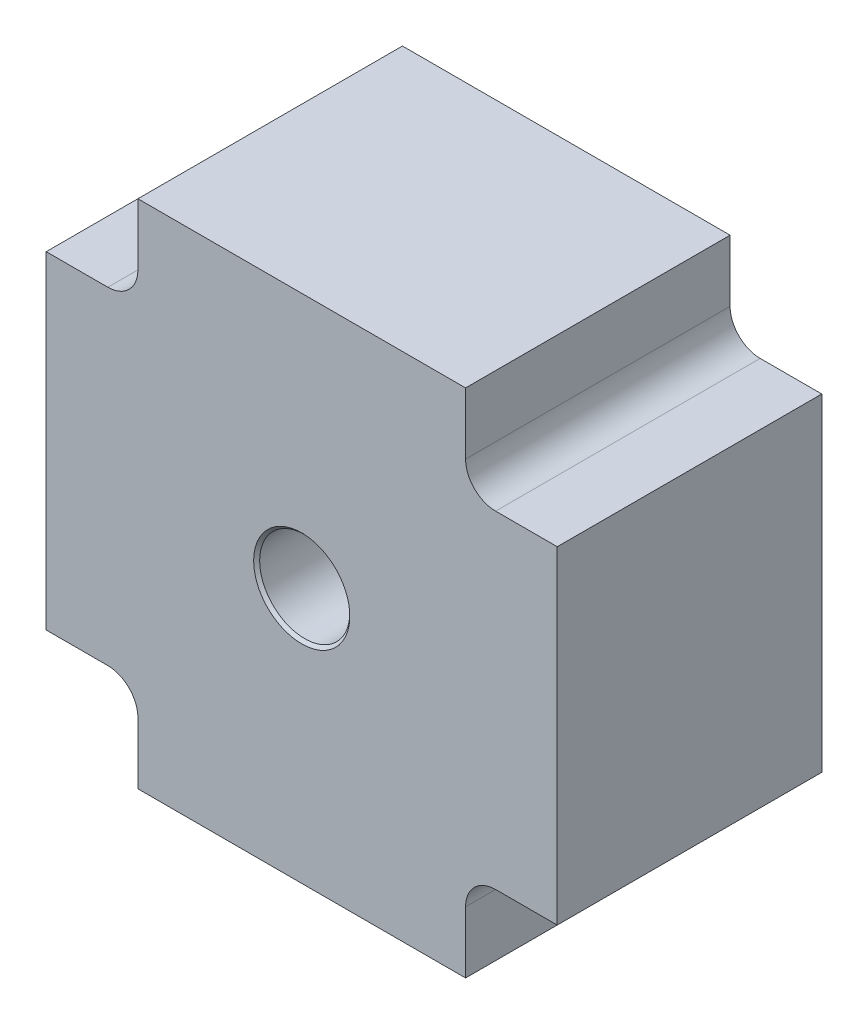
ISO-10303-21;
HEADER;
FILE_DESCRIPTION(('STEP AP214'),'2;1');
FILE_NAME('part.step','',(''),(''),'','','');
FILE_SCHEMA(('AUTOMOTIVE_DESIGN { 1 0 10303 214 1 1 1 1 }'));
ENDSEC;
DATA;
#1=APPLICATION_CONTEXT('core data for automotive mechanical design processes');
#2=APPLICATION_PROTOCOL_DEFINITION('international standard','automotive_design',2000,#1);
#3=PRODUCT_CONTEXT('',#1,'mechanical');
#4=PRODUCT('Part','Part','',(#3));
#5=PRODUCT_RELATED_PRODUCT_CATEGORY('part','',(#4));
#6=PRODUCT_DEFINITION_FORMATION('','',#4);
#7=PRODUCT_DEFINITION_CONTEXT('part definition',#1,'design');
#8=PRODUCT_DEFINITION('design','',#6,#7);
#9=PRODUCT_DEFINITION_SHAPE('','',#8);
#10=(LENGTH_UNIT() NAMED_UNIT(*) SI_UNIT(.MILLI.,.METRE.));
#11=(NAMED_UNIT(*) PLANE_ANGLE_UNIT() SI_UNIT($,.RADIAN.));
#12=(NAMED_UNIT(*) SI_UNIT($,.STERADIAN.) SOLID_ANGLE_UNIT());
#13=UNCERTAINTY_MEASURE_WITH_UNIT(LENGTH_MEASURE(1.E-05),#10,'distance_accuracy_value','');
#14=(GEOMETRIC_REPRESENTATION_CONTEXT(3) GLOBAL_UNCERTAINTY_ASSIGNED_CONTEXT((#13)) GLOBAL_UNIT_ASSIGNED_CONTEXT((#10,
#11,#12)) REPRESENTATION_CONTEXT('',''));
#15=CARTESIAN_POINT('',(0.,0.,0.));
#16=DIRECTION('',(0.,0.,1.));
#17=DIRECTION('',(1.,0.,0.));
#18=AXIS2_PLACEMENT_3D('',#15,#16,#17);
#19=CARTESIAN_POINT('',(-27.25,-27.25,44.));
#20=DIRECTION('',(1.,0.,0.));
#21=DIRECTION('',(0.,1.,0.));
#22=AXIS2_PLACEMENT_3D('',#19,#20,#21);
#23=PLANE('',#22);
#24=DIRECTION('',(0.,-1.,0.));
#25=VECTOR('',#24,1.);
#26=CARTESIAN_POINT('',(-27.25,-27.25,44.));
#27=LINE('',#26,#25);
#28=CARTESIAN_POINT('',(-27.25,-32.25,44.));
#29=VERTEX_POINT('',#28);
#30=CARTESIAN_POINT('',(-27.25,-42.5,44.));
#31=VERTEX_POINT('',#30);
#32=EDGE_CURVE('E149',#29,#31,#27,.T.);
#33=ORIENTED_EDGE('',*,*,#32,.F.);
#34=DIRECTION('',(0.,0.,-1.));
#35=VECTOR('',#34,1.);
#36=CARTESIAN_POINT('',(-27.25,-32.25,0.));
#37=LINE('',#36,#35);
#38=CARTESIAN_POINT('',(-27.25,-32.25,0.));
#39=VERTEX_POINT('',#38);
#40=EDGE_CURVE('E193',#29,#39,#37,.T.);
#41=ORIENTED_EDGE('',*,*,#40,.T.);
#42=DIRECTION('',(0.,-1.,0.));
#43=VECTOR('',#42,1.);
#44=CARTESIAN_POINT('',(-27.25,-27.25,0.));
#45=LINE('',#44,#43);
#46=CARTESIAN_POINT('',(-27.25,-42.5,0.));
#47=VERTEX_POINT('',#46);
#48=EDGE_CURVE('E174',#39,#47,#45,.T.);
#49=ORIENTED_EDGE('',*,*,#48,.T.);
#50=DIRECTION('',(0.,0.,-1.));
#51=VECTOR('',#50,1.);
#52=CARTESIAN_POINT('',(-27.25,-42.5,44.));
#53=LINE('',#52,#51);
#54=EDGE_CURVE('E167',#31,#47,#53,.T.);
#55=ORIENTED_EDGE('',*,*,#54,.F.);
#56=EDGE_LOOP('',(#33,#41,#49,#55));
#57=FACE_BOUND('',#56,.T.);
#58=ADVANCED_FACE('F37',(#57),#23,.F.);
#59=CARTESIAN_POINT('',(27.25,-42.5,44.));
#60=DIRECTION('',(0.,1.,0.));
#61=DIRECTION('',(-1.,0.,0.));
#62=AXIS2_PLACEMENT_3D('',#59,#60,#61);
#63=PLANE('',#62);
#64=DIRECTION('',(1.,0.,0.));
#65=VECTOR('',#64,1.);
#66=CARTESIAN_POINT('',(27.25,-42.5,0.));
#67=LINE('',#66,#65);
#68=CARTESIAN_POINT('',(27.25,-42.5,0.));
#69=VERTEX_POINT('',#68);
#70=EDGE_CURVE('E292',#47,#69,#67,.T.);
#71=ORIENTED_EDGE('',*,*,#70,.T.);
#72=DIRECTION('',(0.,0.,-1.));
#73=VECTOR('',#72,1.);
#74=CARTESIAN_POINT('',(27.25,-42.5,44.));
#75=LINE('',#74,#73);
#76=CARTESIAN_POINT('',(27.25,-42.5,44.));
#77=VERTEX_POINT('',#76);
#78=EDGE_CURVE('E169',#77,#69,#75,.T.);
#79=ORIENTED_EDGE('',*,*,#78,.F.);
#80=DIRECTION('',(1.,0.,0.));
#81=VECTOR('',#80,1.);
#82=CARTESIAN_POINT('',(27.25,-42.5,44.));
#83=LINE('',#82,#81);
#84=EDGE_CURVE('E154',#31,#77,#83,.T.);
#85=ORIENTED_EDGE('',*,*,#84,.F.);
#86=ORIENTED_EDGE('',*,*,#54,.T.);
#87=EDGE_LOOP('',(#71,#79,#85,#86));
#88=FACE_BOUND('',#87,.T.);
#89=ADVANCED_FACE('F166',(#88),#63,.F.);
#90=CARTESIAN_POINT('',(27.25,-27.25,44.));
#91=DIRECTION('',(-1.,0.,0.));
#92=DIRECTION('',(0.,0.,1.));
#93=AXIS2_PLACEMENT_3D('',#90,#91,#92);
#94=PLANE('',#93);
#95=DIRECTION('',(0.,1.,0.));
#96=VECTOR('',#95,1.);
#97=CARTESIAN_POINT('',(27.25,-27.25,0.));
#98=LINE('',#97,#96);
#99=CARTESIAN_POINT('',(27.25,-32.25,0.));
#100=VERTEX_POINT('',#99);
#101=EDGE_CURVE('E291',#69,#100,#98,.T.);
#102=ORIENTED_EDGE('',*,*,#101,.T.);
#103=DIRECTION('',(0.,0.,-1.));
#104=VECTOR('',#103,1.);
#105=CARTESIAN_POINT('',(27.25,-32.25,44.));
#106=LINE('',#105,#104);
#107=CARTESIAN_POINT('',(27.25,-32.25,44.));
#108=VERTEX_POINT('',#107);
#109=EDGE_CURVE('E200',#100,#108,#106,.F.);
#110=ORIENTED_EDGE('',*,*,#109,.T.);
#111=DIRECTION('',(0.,1.,0.));
#112=VECTOR('',#111,1.);
#113=CARTESIAN_POINT('',(27.25,-27.25,44.));
#114=LINE('',#113,#112);
#115=EDGE_CURVE('E171',#77,#108,#114,.T.);
#116=ORIENTED_EDGE('',*,*,#115,.F.);
#117=ORIENTED_EDGE('',*,*,#78,.T.);
#118=EDGE_LOOP('',(#102,#110,#116,#117));
#119=FACE_BOUND('',#118,.T.);
#120=ADVANCED_FACE('F317',(#119),#94,.F.);
#121=CARTESIAN_POINT('',(42.5,-27.25,44.));
#122=DIRECTION('',(0.,1.,0.));
#123=DIRECTION('',(0.,0.,1.));
#124=AXIS2_PLACEMENT_3D('',#121,#122,#123);
#125=PLANE('',#124);
#126=DIRECTION('',(1.,0.,0.));
#127=VECTOR('',#126,1.);
#128=CARTESIAN_POINT('',(42.5,-27.25,44.));
#129=LINE('',#128,#127);
#130=CARTESIAN_POINT('',(32.25,-27.25,44.));
#131=VERTEX_POINT('',#130);
#132=CARTESIAN_POINT('',(42.5,-27.25,44.));
#133=VERTEX_POINT('',#132);
#134=EDGE_CURVE('E307',#131,#133,#129,.T.);
#135=ORIENTED_EDGE('',*,*,#134,.F.);
#136=DIRECTION('',(0.,0.,-1.));
#137=VECTOR('',#136,1.);
#138=CARTESIAN_POINT('',(32.25,-27.25,0.));
#139=LINE('',#138,#137);
#140=CARTESIAN_POINT('',(32.25,-27.25,0.));
#141=VERTEX_POINT('',#140);
#142=EDGE_CURVE('E197',#131,#141,#139,.T.);
#143=ORIENTED_EDGE('',*,*,#142,.T.);
#144=DIRECTION('',(1.,0.,0.));
#145=VECTOR('',#144,1.);
#146=CARTESIAN_POINT('',(42.5,-27.25,0.));
#147=LINE('',#146,#145);
#148=CARTESIAN_POINT('',(42.5,-27.25,0.));
#149=VERTEX_POINT('',#148);
#150=EDGE_CURVE('E256',#141,#149,#147,.T.);
#151=ORIENTED_EDGE('',*,*,#150,.T.);
#152=DIRECTION('',(0.,0.,-1.));
#153=VECTOR('',#152,1.);
#154=CARTESIAN_POINT('',(42.5,-27.25,44.));
#155=LINE('',#154,#153);
#156=EDGE_CURVE('E181',#133,#149,#155,.T.);
#157=ORIENTED_EDGE('',*,*,#156,.F.);
#158=EDGE_LOOP('',(#135,#143,#151,#157));
#159=FACE_BOUND('',#158,.T.);
#160=ADVANCED_FACE('F315',(#159),#125,.F.);
#161=CARTESIAN_POINT('',(42.5,-27.25,44.));
#162=DIRECTION('',(-1.,0.,0.));
#163=DIRECTION('',(0.,0.,1.));
#164=AXIS2_PLACEMENT_3D('',#161,#162,#163);
#165=PLANE('',#164);
#166=DIRECTION('',(0.,1.,0.));
#167=VECTOR('',#166,1.);
#168=CARTESIAN_POINT('',(42.5,-27.25,0.));
#169=LINE('',#168,#167);
#170=CARTESIAN_POINT('',(42.5,27.25,0.));
#171=VERTEX_POINT('',#170);
#172=EDGE_CURVE('E252',#149,#171,#169,.T.);
#173=ORIENTED_EDGE('',*,*,#172,.T.);
#174=DIRECTION('',(0.,0.,-1.));
#175=VECTOR('',#174,1.);
#176=CARTESIAN_POINT('',(42.5,27.25,44.));
#177=LINE('',#176,#175);
#178=CARTESIAN_POINT('',(42.5,27.25,44.));
#179=VERTEX_POINT('',#178);
#180=EDGE_CURVE('E251',#179,#171,#177,.T.);
#181=ORIENTED_EDGE('',*,*,#180,.F.);
#182=DIRECTION('',(0.,1.,0.));
#183=VECTOR('',#182,1.);
#184=CARTESIAN_POINT('',(42.5,-27.25,44.));
#185=LINE('',#184,#183);
#186=EDGE_CURVE('E285',#133,#179,#185,.T.);
#187=ORIENTED_EDGE('',*,*,#186,.F.);
#188=ORIENTED_EDGE('',*,*,#156,.T.);
#189=EDGE_LOOP('',(#173,#181,#187,#188));
#190=FACE_BOUND('',#189,.T.);
#191=ADVANCED_FACE('F284',(#190),#165,.F.);
#192=CARTESIAN_POINT('',(42.5,27.25,44.));
#193=DIRECTION('',(0.,-1.,0.));
#194=DIRECTION('',(1.,0.,0.));
#195=AXIS2_PLACEMENT_3D('',#192,#193,#194);
#196=PLANE('',#195);
#197=DIRECTION('',(-1.,0.,0.));
#198=VECTOR('',#197,1.);
#199=CARTESIAN_POINT('',(42.5,27.25,0.));
#200=LINE('',#199,#198);
#201=CARTESIAN_POINT('',(32.25,27.25,0.));
#202=VERTEX_POINT('',#201);
#203=EDGE_CURVE('E244',#171,#202,#200,.T.);
#204=ORIENTED_EDGE('',*,*,#203,.T.);
#205=DIRECTION('',(0.,0.,-1.));
#206=VECTOR('',#205,1.);
#207=CARTESIAN_POINT('',(32.25,27.25,44.));
#208=LINE('',#207,#206);
#209=CARTESIAN_POINT('',(32.25,27.25,44.));
#210=VERTEX_POINT('',#209);
#211=EDGE_CURVE('E205',#202,#210,#208,.F.);
#212=ORIENTED_EDGE('',*,*,#211,.T.);
#213=DIRECTION('',(-1.,0.,0.));
#214=VECTOR('',#213,1.);
#215=CARTESIAN_POINT('',(42.5,27.25,44.));
#216=LINE('',#215,#214);
#217=EDGE_CURVE('E227',#179,#210,#216,.T.);
#218=ORIENTED_EDGE('',*,*,#217,.F.);
#219=ORIENTED_EDGE('',*,*,#180,.T.);
#220=EDGE_LOOP('',(#204,#212,#218,#219));
#221=FACE_BOUND('',#220,.T.);
#222=ADVANCED_FACE('F249',(#221),#196,.F.);
#223=CARTESIAN_POINT('',(27.25,42.5,44.));
#224=DIRECTION('',(-1.,0.,0.));
#225=DIRECTION('',(0.,-1.,0.));
#226=AXIS2_PLACEMENT_3D('',#223,#224,#225);
#227=PLANE('',#226);
#228=DIRECTION('',(0.,1.,0.));
#229=VECTOR('',#228,1.);
#230=CARTESIAN_POINT('',(27.25,42.5,44.));
#231=LINE('',#230,#229);
#232=CARTESIAN_POINT('',(27.25,32.25,44.));
#233=VERTEX_POINT('',#232);
#234=CARTESIAN_POINT('',(27.25,42.5,44.));
#235=VERTEX_POINT('',#234);
#236=EDGE_CURVE('E224',#233,#235,#231,.T.);
#237=ORIENTED_EDGE('',*,*,#236,.F.);
#238=DIRECTION('',(0.,0.,-1.));
#239=VECTOR('',#238,1.);
#240=CARTESIAN_POINT('',(27.25,32.25,0.));
#241=LINE('',#240,#239);
#242=CARTESIAN_POINT('',(27.25,32.25,0.));
#243=VERTEX_POINT('',#242);
#244=EDGE_CURVE('E202',#233,#243,#241,.T.);
#245=ORIENTED_EDGE('',*,*,#244,.T.);
#246=DIRECTION('',(0.,1.,0.));
#247=VECTOR('',#246,1.);
#248=CARTESIAN_POINT('',(27.25,42.5,0.));
#249=LINE('',#248,#247);
#250=CARTESIAN_POINT('',(27.25,42.5,0.));
#251=VERTEX_POINT('',#250);
#252=EDGE_CURVE('E246',#243,#251,#249,.T.);
#253=ORIENTED_EDGE('',*,*,#252,.T.);
#254=DIRECTION('',(0.,0.,-1.));
#255=VECTOR('',#254,1.);
#256=CARTESIAN_POINT('',(27.25,42.5,44.));
#257=LINE('',#256,#255);
#258=EDGE_CURVE('E235',#235,#251,#257,.T.);
#259=ORIENTED_EDGE('',*,*,#258,.F.);
#260=EDGE_LOOP('',(#237,#245,#253,#259));
#261=FACE_BOUND('',#260,.T.);
#262=ADVANCED_FACE('F232',(#261),#227,.F.);
#263=CARTESIAN_POINT('',(27.25,42.5,44.));
#264=DIRECTION('',(0.,-1.,0.));
#265=DIRECTION('',(1.,0.,0.));
#266=AXIS2_PLACEMENT_3D('',#263,#264,#265);
#267=PLANE('',#266);
#268=DIRECTION('',(-1.,0.,0.));
#269=VECTOR('',#268,1.);
#270=CARTESIAN_POINT('',(27.25,42.5,0.));
#271=LINE('',#270,#269);
#272=CARTESIAN_POINT('',(-27.25,42.5,0.));
#273=VERTEX_POINT('',#272);
#274=EDGE_CURVE('E254',#251,#273,#271,.T.);
#275=ORIENTED_EDGE('',*,*,#274,.T.);
#276=DIRECTION('',(0.,0.,-1.));
#277=VECTOR('',#276,1.);
#278=CARTESIAN_POINT('',(-27.25,42.5,44.));
#279=LINE('',#278,#277);
#280=CARTESIAN_POINT('',(-27.25,42.5,44.));
#281=VERTEX_POINT('',#280);
#282=EDGE_CURVE('E276',#281,#273,#279,.T.);
#283=ORIENTED_EDGE('',*,*,#282,.F.);
#284=DIRECTION('',(-1.,0.,0.));
#285=VECTOR('',#284,1.);
#286=CARTESIAN_POINT('',(27.25,42.5,44.));
#287=LINE('',#286,#285);
#288=EDGE_CURVE('E237',#235,#281,#287,.T.);
#289=ORIENTED_EDGE('',*,*,#288,.F.);
#290=ORIENTED_EDGE('',*,*,#258,.T.);
#291=EDGE_LOOP('',(#275,#283,#289,#290));
#292=FACE_BOUND('',#291,.T.);
#293=ADVANCED_FACE('F385',(#292),#267,.F.);
#294=CARTESIAN_POINT('',(-27.25,42.5,44.));
#295=DIRECTION('',(1.,0.,0.));
#296=DIRECTION('',(0.,0.,-1.));
#297=AXIS2_PLACEMENT_3D('',#294,#295,#296);
#298=PLANE('',#297);
#299=DIRECTION('',(0.,-1.,0.));
#300=VECTOR('',#299,1.);
#301=CARTESIAN_POINT('',(-27.25,42.5,0.));
#302=LINE('',#301,#300);
#303=CARTESIAN_POINT('',(-27.25,32.25,0.));
#304=VERTEX_POINT('',#303);
#305=EDGE_CURVE('E261',#273,#304,#302,.T.);
#306=ORIENTED_EDGE('',*,*,#305,.T.);
#307=DIRECTION('',(0.,0.,-1.));
#308=VECTOR('',#307,1.);
#309=CARTESIAN_POINT('',(-27.25,32.25,44.));
#310=LINE('',#309,#308);
#311=CARTESIAN_POINT('',(-27.25,32.25,44.));
#312=VERTEX_POINT('',#311);
#313=EDGE_CURVE('E52',#304,#312,#310,.F.);
#314=ORIENTED_EDGE('',*,*,#313,.T.);
#315=DIRECTION('',(0.,-1.,0.));
#316=VECTOR('',#315,1.);
#317=CARTESIAN_POINT('',(-27.25,42.5,44.));
#318=LINE('',#317,#316);
#319=EDGE_CURVE('E302',#281,#312,#318,.T.);
#320=ORIENTED_EDGE('',*,*,#319,.F.);
#321=ORIENTED_EDGE('',*,*,#282,.T.);
#322=EDGE_LOOP('',(#306,#314,#320,#321));
#323=FACE_BOUND('',#322,.T.);
#324=ADVANCED_FACE('F382',(#323),#298,.F.);
#325=CARTESIAN_POINT('',(-27.25,27.25,44.));
#326=DIRECTION('',(0.,-1.,0.));
#327=DIRECTION('',(0.,0.,-1.));
#328=AXIS2_PLACEMENT_3D('',#325,#326,#327);
#329=PLANE('',#328);
#330=DIRECTION('',(-1.,0.,0.));
#331=VECTOR('',#330,1.);
#332=CARTESIAN_POINT('',(-27.25,27.25,44.));
#333=LINE('',#332,#331);
#334=CARTESIAN_POINT('',(-32.25,27.25,44.));
#335=VERTEX_POINT('',#334);
#336=CARTESIAN_POINT('',(-42.5,27.25,44.));
#337=VERTEX_POINT('',#336);
#338=EDGE_CURVE('E300',#335,#337,#333,.T.);
#339=ORIENTED_EDGE('',*,*,#338,.F.);
#340=DIRECTION('',(0.,0.,-1.));
#341=VECTOR('',#340,1.);
#342=CARTESIAN_POINT('',(-32.25,27.25,0.));
#343=LINE('',#342,#341);
#344=CARTESIAN_POINT('',(-32.25,27.25,0.));
#345=VERTEX_POINT('',#344);
#346=EDGE_CURVE('E207',#335,#345,#343,.T.);
#347=ORIENTED_EDGE('',*,*,#346,.T.);
#348=DIRECTION('',(-1.,0.,0.));
#349=VECTOR('',#348,1.);
#350=CARTESIAN_POINT('',(-27.25,27.25,0.));
#351=LINE('',#350,#349);
#352=CARTESIAN_POINT('',(-42.5,27.25,0.));
#353=VERTEX_POINT('',#352);
#354=EDGE_CURVE('E263',#345,#353,#351,.T.);
#355=ORIENTED_EDGE('',*,*,#354,.T.);
#356=DIRECTION('',(0.,0.,-1.));
#357=VECTOR('',#356,1.);
#358=CARTESIAN_POINT('',(-42.5,27.25,44.));
#359=LINE('',#358,#357);
#360=EDGE_CURVE('E272',#337,#353,#359,.T.);
#361=ORIENTED_EDGE('',*,*,#360,.F.);
#362=EDGE_LOOP('',(#339,#347,#355,#361));
#363=FACE_BOUND('',#362,.T.);
#364=ADVANCED_FACE('F358',(#363),#329,.F.);
#365=CARTESIAN_POINT('',(-42.5,-27.25,44.));
#366=DIRECTION('',(1.,0.,0.));
#367=DIRECTION('',(0.,0.,-1.));
#368=AXIS2_PLACEMENT_3D('',#365,#366,#367);
#369=PLANE('',#368);
#370=DIRECTION('',(0.,-1.,0.));
#371=VECTOR('',#370,1.);
#372=CARTESIAN_POINT('',(-42.5,-27.25,0.));
#373=LINE('',#372,#371);
#374=CARTESIAN_POINT('',(-42.5,-27.25,0.));
#375=VERTEX_POINT('',#374);
#376=EDGE_CURVE('E265',#353,#375,#373,.T.);
#377=ORIENTED_EDGE('',*,*,#376,.T.);
#378=DIRECTION('',(0.,0.,-1.));
#379=VECTOR('',#378,1.);
#380=CARTESIAN_POINT('',(-42.5,-27.25,44.));
#381=LINE('',#380,#379);
#382=CARTESIAN_POINT('',(-42.5,-27.25,44.));
#383=VERTEX_POINT('',#382);
#384=EDGE_CURVE('E269',#383,#375,#381,.T.);
#385=ORIENTED_EDGE('',*,*,#384,.F.);
#386=DIRECTION('',(0.,-1.,0.));
#387=VECTOR('',#386,1.);
#388=CARTESIAN_POINT('',(-42.5,-27.25,44.));
#389=LINE('',#388,#387);
#390=EDGE_CURVE('E298',#337,#383,#389,.T.);
#391=ORIENTED_EDGE('',*,*,#390,.F.);
#392=ORIENTED_EDGE('',*,*,#360,.T.);
#393=EDGE_LOOP('',(#377,#385,#391,#392));
#394=FACE_BOUND('',#393,.T.);
#395=ADVANCED_FACE('F363',(#394),#369,.F.);
#396=CARTESIAN_POINT('',(-27.25,-27.25,44.));
#397=DIRECTION('',(0.,1.,0.));
#398=DIRECTION('',(-1.,0.,0.));
#399=AXIS2_PLACEMENT_3D('',#396,#397,#398);
#400=PLANE('',#399);
#401=DIRECTION('',(1.,0.,0.));
#402=VECTOR('',#401,1.);
#403=CARTESIAN_POINT('',(-27.25,-27.25,0.));
#404=LINE('',#403,#402);
#405=CARTESIAN_POINT('',(-32.25,-27.25,0.));
#406=VERTEX_POINT('',#405);
#407=EDGE_CURVE('E162',#375,#406,#404,.T.);
#408=ORIENTED_EDGE('',*,*,#407,.T.);
#409=DIRECTION('',(0.,0.,-1.));
#410=VECTOR('',#409,1.);
#411=CARTESIAN_POINT('',(-32.25,-27.25,44.));
#412=LINE('',#411,#410);
#413=CARTESIAN_POINT('',(-32.25,-27.25,44.));
#414=VERTEX_POINT('',#413);
#415=EDGE_CURVE('E195',#406,#414,#412,.F.);
#416=ORIENTED_EDGE('',*,*,#415,.T.);
#417=DIRECTION('',(1.,0.,0.));
#418=VECTOR('',#417,1.);
#419=CARTESIAN_POINT('',(-27.25,-27.25,44.));
#420=LINE('',#419,#418);
#421=EDGE_CURVE('E273',#383,#414,#420,.T.);
#422=ORIENTED_EDGE('',*,*,#421,.F.);
#423=ORIENTED_EDGE('',*,*,#384,.T.);
#424=EDGE_LOOP('',(#408,#416,#422,#423));
#425=FACE_BOUND('',#424,.T.);
#426=ADVANCED_FACE('F368',(#425),#400,.F.);
#427=CARTESIAN_POINT('',(0.,0.,44.));
#428=DIRECTION('',(0.,0.,-1.));
#429=DIRECTION('',(-1.,0.,0.));
#430=AXIS2_PLACEMENT_3D('',#427,#428,#429);
#431=PLANE('',#430);
#432=CARTESIAN_POINT('',(0.,0.,44.));
#433=DIRECTION('',(0.,0.,-1.));
#434=DIRECTION('',(-1.,0.,0.));
#435=AXIS2_PLACEMENT_3D('',#432,#433,#434);
#436=CIRCLE('',#435,8.00000000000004);
#437=CARTESIAN_POINT('',(-8.00000000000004,0.,44.));
#438=VERTEX_POINT('',#437);
#439=EDGE_CURVE('E190',#438,#438,#436,.T.);
#440=ORIENTED_EDGE('',*,*,#439,.T.);
#441=EDGE_LOOP('',(#440));
#442=FACE_BOUND('',#441,.T.);
#443=ORIENTED_EDGE('',*,*,#421,.T.);
#444=CARTESIAN_POINT('',(-32.25,-32.25,44.));
#445=DIRECTION('',(0.,0.,-1.));
#446=DIRECTION('',(-1.,0.,0.));
#447=AXIS2_PLACEMENT_3D('',#444,#445,#446);
#448=CIRCLE('',#447,5.);
#449=EDGE_CURVE('E157',#414,#29,#448,.T.);
#450=ORIENTED_EDGE('',*,*,#449,.T.);
#451=ORIENTED_EDGE('',*,*,#32,.T.);
#452=ORIENTED_EDGE('',*,*,#84,.T.);
#453=ORIENTED_EDGE('',*,*,#115,.T.);
#454=CARTESIAN_POINT('',(32.25,-32.25,44.));
#455=DIRECTION('',(0.,0.,-1.));
#456=DIRECTION('',(-1.,0.,0.));
#457=AXIS2_PLACEMENT_3D('',#454,#455,#456);
#458=CIRCLE('',#457,5.);
#459=EDGE_CURVE('E216',#108,#131,#458,.T.);
#460=ORIENTED_EDGE('',*,*,#459,.T.);
#461=ORIENTED_EDGE('',*,*,#134,.T.);
#462=ORIENTED_EDGE('',*,*,#186,.T.);
#463=ORIENTED_EDGE('',*,*,#217,.T.);
#464=CARTESIAN_POINT('',(32.25,32.25,44.));
#465=DIRECTION('',(0.,0.,-1.));
#466=DIRECTION('',(-1.,0.,0.));
#467=AXIS2_PLACEMENT_3D('',#464,#465,#466);
#468=CIRCLE('',#467,5.);
#469=EDGE_CURVE('E220',#210,#233,#468,.T.);
#470=ORIENTED_EDGE('',*,*,#469,.T.);
#471=ORIENTED_EDGE('',*,*,#236,.T.);
#472=ORIENTED_EDGE('',*,*,#288,.T.);
#473=ORIENTED_EDGE('',*,*,#319,.T.);
#474=CARTESIAN_POINT('',(-32.25,32.25,44.));
#475=DIRECTION('',(0.,0.,-1.));
#476=DIRECTION('',(-1.,0.,0.));
#477=AXIS2_PLACEMENT_3D('',#474,#475,#476);
#478=CIRCLE('',#477,5.);
#479=EDGE_CURVE('E11',#312,#335,#478,.T.);
#480=ORIENTED_EDGE('',*,*,#479,.T.);
#481=ORIENTED_EDGE('',*,*,#338,.T.);
#482=ORIENTED_EDGE('',*,*,#390,.T.);
#483=EDGE_LOOP('',(#443,#450,#451,#452,#453,#460,#461,#462,#463,#470,#471,#472,#473,#480,#481,#482));
#484=FACE_BOUND('',#483,.T.);
#485=ADVANCED_FACE('F152',(#442,#484),#431,.F.);
#486=CARTESIAN_POINT('',(0.,0.,0.));
#487=DIRECTION('',(0.,0.,-1.));
#488=DIRECTION('',(-1.,0.,0.));
#489=AXIS2_PLACEMENT_3D('',#486,#487,#488);
#490=PLANE('',#489);
#491=CARTESIAN_POINT('',(0.,0.,0.));
#492=DIRECTION('',(0.,0.,-1.));
#493=DIRECTION('',(-1.,0.,0.));
#494=AXIS2_PLACEMENT_3D('',#491,#492,#493);
#495=CIRCLE('',#494,7.99999999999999);
#496=CARTESIAN_POINT('',(-7.99999999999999,0.,0.));
#497=VERTEX_POINT('',#496);
#498=EDGE_CURVE('E176',#497,#497,#495,.F.);
#499=ORIENTED_EDGE('',*,*,#498,.T.);
#500=EDGE_LOOP('',(#499));
#501=FACE_BOUND('',#500,.T.);
#502=ORIENTED_EDGE('',*,*,#48,.F.);
#503=CARTESIAN_POINT('',(-32.25,-32.25,0.));
#504=DIRECTION('',(0.,0.,-1.));
#505=DIRECTION('',(-1.,0.,0.));
#506=AXIS2_PLACEMENT_3D('',#503,#504,#505);
#507=CIRCLE('',#506,5.);
#508=EDGE_CURVE('E211',#39,#406,#507,.F.);
#509=ORIENTED_EDGE('',*,*,#508,.T.);
#510=ORIENTED_EDGE('',*,*,#407,.F.);
#511=ORIENTED_EDGE('',*,*,#376,.F.);
#512=ORIENTED_EDGE('',*,*,#354,.F.);
#513=CARTESIAN_POINT('',(-32.25,32.25,0.));
#514=DIRECTION('',(0.,0.,-1.));
#515=DIRECTION('',(-1.,0.,0.));
#516=AXIS2_PLACEMENT_3D('',#513,#514,#515);
#517=CIRCLE('',#516,5.);
#518=EDGE_CURVE('E45',#345,#304,#517,.F.);
#519=ORIENTED_EDGE('',*,*,#518,.T.);
#520=ORIENTED_EDGE('',*,*,#305,.F.);
#521=ORIENTED_EDGE('',*,*,#274,.F.);
#522=ORIENTED_EDGE('',*,*,#252,.F.);
#523=CARTESIAN_POINT('',(32.25,32.25,0.));
#524=DIRECTION('',(0.,0.,-1.));
#525=DIRECTION('',(-1.,0.,0.));
#526=AXIS2_PLACEMENT_3D('',#523,#524,#525);
#527=CIRCLE('',#526,5.);
#528=EDGE_CURVE('E218',#243,#202,#527,.F.);
#529=ORIENTED_EDGE('',*,*,#528,.T.);
#530=ORIENTED_EDGE('',*,*,#203,.F.);
#531=ORIENTED_EDGE('',*,*,#172,.F.);
#532=ORIENTED_EDGE('',*,*,#150,.F.);
#533=CARTESIAN_POINT('',(32.25,-32.25,0.));
#534=DIRECTION('',(0.,0.,-1.));
#535=DIRECTION('',(-1.,0.,0.));
#536=AXIS2_PLACEMENT_3D('',#533,#534,#535);
#537=CIRCLE('',#536,5.);
#538=EDGE_CURVE('E214',#141,#100,#537,.F.);
#539=ORIENTED_EDGE('',*,*,#538,.T.);
#540=ORIENTED_EDGE('',*,*,#101,.F.);
#541=ORIENTED_EDGE('',*,*,#70,.F.);
#542=EDGE_LOOP('',(#502,#509,#510,#511,#512,#519,#520,#521,#522,#529,#530,#531,#532,#539,#540,#541));
#543=FACE_BOUND('',#542,.T.);
#544=ADVANCED_FACE('F242',(#501,#543),#490,.T.);
#545=CARTESIAN_POINT('',(0.,0.,0.));
#546=DIRECTION('',(0.,0.,1.));
#547=DIRECTION('',(1.,0.,0.));
#548=AXIS2_PLACEMENT_3D('',#545,#546,#547);
#549=CYLINDRICAL_SURFACE('',#548,7.5);
#550=CARTESIAN_POINT('',(0.,0.,0.499999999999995));
#551=DIRECTION('',(0.,0.,-1.));
#552=DIRECTION('',(-1.,0.,0.));
#553=AXIS2_PLACEMENT_3D('',#550,#551,#552);
#554=CIRCLE('',#553,7.5);
#555=CARTESIAN_POINT('',(-7.5,0.,0.499999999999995));
#556=VERTEX_POINT('',#555);
#557=EDGE_CURVE('E187',#556,#556,#554,.T.);
#558=ORIENTED_EDGE('',*,*,#557,.T.);
#559=EDGE_LOOP('',(#558));
#560=FACE_BOUND('',#559,.T.);
#561=CARTESIAN_POINT('',(0.,0.,43.5));
#562=DIRECTION('',(0.,0.,-1.));
#563=DIRECTION('',(-1.,0.,0.));
#564=AXIS2_PLACEMENT_3D('',#561,#562,#563);
#565=CIRCLE('',#564,7.5);
#566=CARTESIAN_POINT('',(-7.5,0.,43.5));
#567=VERTEX_POINT('',#566);
#568=EDGE_CURVE('E179',#567,#567,#565,.F.);
#569=ORIENTED_EDGE('',*,*,#568,.T.);
#570=EDGE_LOOP('',(#569));
#571=FACE_BOUND('',#570,.T.);
#572=ADVANCED_FACE('F336',(#560,#571),#549,.F.);
#573=CARTESIAN_POINT('',(0.,0.,0.));
#574=DIRECTION('',(0.,0.,-1.));
#575=DIRECTION('',(-1.,0.,0.));
#576=AXIS2_PLACEMENT_3D('',#573,#574,#575);
#577=CONICAL_SURFACE('',#576,7.99999999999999,0.785398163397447);
#578=ORIENTED_EDGE('',*,*,#557,.F.);
#579=EDGE_LOOP('',(#578));
#580=FACE_BOUND('',#579,.T.);
#581=ORIENTED_EDGE('',*,*,#498,.F.);
#582=EDGE_LOOP('',(#581));
#583=FACE_BOUND('',#582,.T.);
#584=ADVANCED_FACE('F332',(#580,#583),#577,.F.);
#585=CARTESIAN_POINT('',(0.,0.,43.5));
#586=DIRECTION('',(0.,0.,1.));
#587=DIRECTION('',(1.,0.,0.));
#588=AXIS2_PLACEMENT_3D('',#585,#586,#587);
#589=CONICAL_SURFACE('',#588,7.5,0.785398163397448);
#590=ORIENTED_EDGE('',*,*,#439,.F.);
#591=EDGE_LOOP('',(#590));
#592=FACE_BOUND('',#591,.T.);
#593=ORIENTED_EDGE('',*,*,#568,.F.);
#594=EDGE_LOOP('',(#593));
#595=FACE_BOUND('',#594,.T.);
#596=ADVANCED_FACE('F335',(#592,#595),#589,.F.);
#597=CARTESIAN_POINT('',(-32.25,-32.25,44.));
#598=DIRECTION('',(0.,0.,1.));
#599=DIRECTION('',(1.,0.,0.));
#600=AXIS2_PLACEMENT_3D('',#597,#598,#599);
#601=CYLINDRICAL_SURFACE('',#600,5.);
#602=ORIENTED_EDGE('',*,*,#449,.F.);
#603=ORIENTED_EDGE('',*,*,#415,.F.);
#604=ORIENTED_EDGE('',*,*,#508,.F.);
#605=ORIENTED_EDGE('',*,*,#40,.F.);
#606=EDGE_LOOP('',(#602,#603,#604,#605));
#607=FACE_BOUND('',#606,.T.);
#608=ADVANCED_FACE('F340',(#607),#601,.F.);
#609=CARTESIAN_POINT('',(32.25,-32.25,44.));
#610=DIRECTION('',(0.,0.,1.));
#611=DIRECTION('',(1.,0.,0.));
#612=AXIS2_PLACEMENT_3D('',#609,#610,#611);
#613=CYLINDRICAL_SURFACE('',#612,5.);
#614=ORIENTED_EDGE('',*,*,#459,.F.);
#615=ORIENTED_EDGE('',*,*,#109,.F.);
#616=ORIENTED_EDGE('',*,*,#538,.F.);
#617=ORIENTED_EDGE('',*,*,#142,.F.);
#618=EDGE_LOOP('',(#614,#615,#616,#617));
#619=FACE_BOUND('',#618,.T.);
#620=ADVANCED_FACE('F314',(#619),#613,.F.);
#621=CARTESIAN_POINT('',(32.25,32.25,44.));
#622=DIRECTION('',(0.,0.,1.));
#623=DIRECTION('',(1.,0.,0.));
#624=AXIS2_PLACEMENT_3D('',#621,#622,#623);
#625=CYLINDRICAL_SURFACE('',#624,5.);
#626=ORIENTED_EDGE('',*,*,#469,.F.);
#627=ORIENTED_EDGE('',*,*,#211,.F.);
#628=ORIENTED_EDGE('',*,*,#528,.F.);
#629=ORIENTED_EDGE('',*,*,#244,.F.);
#630=EDGE_LOOP('',(#626,#627,#628,#629));
#631=FACE_BOUND('',#630,.T.);
#632=ADVANCED_FACE('F239',(#631),#625,.F.);
#633=CARTESIAN_POINT('',(-32.25,32.25,44.));
#634=DIRECTION('',(0.,0.,1.));
#635=DIRECTION('',(1.,0.,0.));
#636=AXIS2_PLACEMENT_3D('',#633,#634,#635);
#637=CYLINDRICAL_SURFACE('',#636,5.);
#638=ORIENTED_EDGE('',*,*,#479,.F.);
#639=ORIENTED_EDGE('',*,*,#313,.F.);
#640=ORIENTED_EDGE('',*,*,#518,.F.);
#641=ORIENTED_EDGE('',*,*,#346,.F.);
#642=EDGE_LOOP('',(#638,#639,#640,#641));
#643=FACE_BOUND('',#642,.T.);
#644=ADVANCED_FACE('F39',(#643),#637,.F.);
#645=CLOSED_SHELL('',(#58,#89,#120,#160,#191,#222,#262,#293,#324,#364,#395,#426,#485,#544,#572,
#584,#596,#608,#620,#632,#644));
#646=MANIFOLD_SOLID_BREP('B2',#645);
#647=ADVANCED_BREP_SHAPE_REPRESENTATION('',(#18,#646),#14);
#648=SHAPE_DEFINITION_REPRESENTATION(#9,#647);
ENDSEC;
END-ISO-10303-21;
